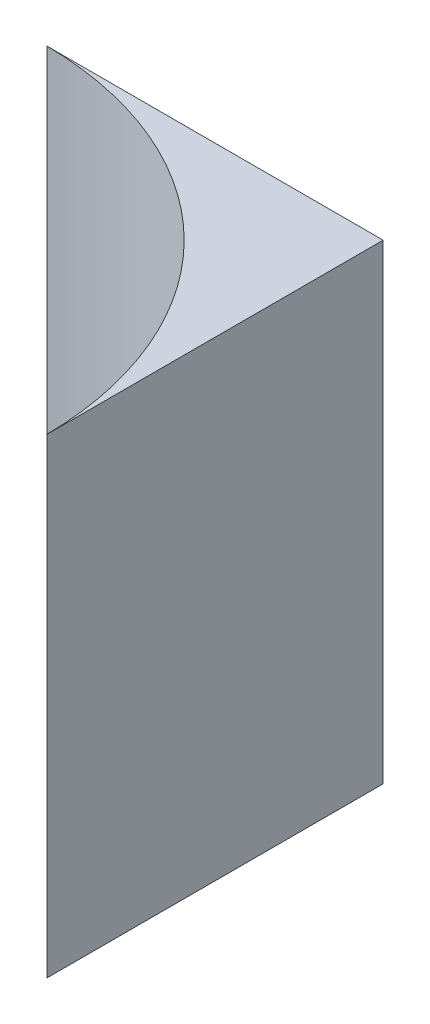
ISO-10303-21;
HEADER;
FILE_DESCRIPTION(('STEP AP214'),'2;1');
FILE_NAME('part.step','',(''),(''),'','','');
FILE_SCHEMA(('AUTOMOTIVE_DESIGN { 1 0 10303 214 1 1 1 1 }'));
ENDSEC;
DATA;
#1=APPLICATION_CONTEXT('core data for automotive mechanical design processes');
#2=APPLICATION_PROTOCOL_DEFINITION('international standard','automotive_design',2000,#1);
#3=PRODUCT_CONTEXT('',#1,'mechanical');
#4=PRODUCT('Part','Part','',(#3));
#5=PRODUCT_RELATED_PRODUCT_CATEGORY('part','',(#4));
#6=PRODUCT_DEFINITION_FORMATION('','',#4);
#7=PRODUCT_DEFINITION_CONTEXT('part definition',#1,'design');
#8=PRODUCT_DEFINITION('design','',#6,#7);
#9=PRODUCT_DEFINITION_SHAPE('','',#8);
#10=(LENGTH_UNIT() NAMED_UNIT(*) SI_UNIT(.MILLI.,.METRE.));
#11=(NAMED_UNIT(*) PLANE_ANGLE_UNIT() SI_UNIT($,.RADIAN.));
#12=(NAMED_UNIT(*) SI_UNIT($,.STERADIAN.) SOLID_ANGLE_UNIT());
#13=UNCERTAINTY_MEASURE_WITH_UNIT(LENGTH_MEASURE(1.E-05),#10,'distance_accuracy_value','');
#14=(GEOMETRIC_REPRESENTATION_CONTEXT(3) GLOBAL_UNCERTAINTY_ASSIGNED_CONTEXT((#13)) GLOBAL_UNIT_ASSIGNED_CONTEXT((#10,
#11,#12)) REPRESENTATION_CONTEXT('',''));
#15=CARTESIAN_POINT('',(0.,0.,0.));
#16=DIRECTION('',(0.,0.,1.));
#17=DIRECTION('',(1.,0.,0.));
#18=AXIS2_PLACEMENT_3D('',#15,#16,#17);
#19=CARTESIAN_POINT('',(-23.2890305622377,33.25,23.2890305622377));
#20=DIRECTION('',(0.,-1.,0.));
#21=DIRECTION('',(0.,0.,-1.));
#22=AXIS2_PLACEMENT_3D('',#19,#20,#21);
#23=CYLINDRICAL_SURFACE('',#22,22.725);
#24=CARTESIAN_POINT('',(-23.2890305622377,1.75,23.2890305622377));
#25=DIRECTION('',(0.,1.,0.));
#26=DIRECTION('',(0.,0.,1.));
#27=AXIS2_PLACEMENT_3D('',#24,#25,#26);
#28=CIRCLE('',#27,22.725);
#29=CARTESIAN_POINT('',(-0.565144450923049,1.75,23.0640305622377));
#30=VERTEX_POINT('',#29);
#31=CARTESIAN_POINT('',(-23.0640305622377,1.75,0.565144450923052));
#32=VERTEX_POINT('',#31);
#33=EDGE_CURVE('E81',#30,#32,#28,.T.);
#34=ORIENTED_EDGE('',*,*,#33,.F.);
#35=DIRECTION('',(0.,-1.,0.));
#36=VECTOR('',#35,1.);
#37=CARTESIAN_POINT('',(-0.565144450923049,33.25,23.0640305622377));
#38=LINE('',#37,#36);
#39=CARTESIAN_POINT('',(-0.565144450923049,33.25,23.0640305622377));
#40=VERTEX_POINT('',#39);
#41=EDGE_CURVE('E50',#40,#30,#38,.T.);
#42=ORIENTED_EDGE('',*,*,#41,.F.);
#43=CARTESIAN_POINT('',(-23.2890305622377,33.25,23.2890305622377));
#44=DIRECTION('',(0.,1.,0.));
#45=DIRECTION('',(0.,0.,1.));
#46=AXIS2_PLACEMENT_3D('',#43,#44,#45);
#47=CIRCLE('',#46,22.725);
#48=CARTESIAN_POINT('',(-23.0640305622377,33.25,0.565144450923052));
#49=VERTEX_POINT('',#48);
#50=EDGE_CURVE('E83',#40,#49,#47,.T.);
#51=ORIENTED_EDGE('',*,*,#50,.T.);
#52=DIRECTION('',(0.,-1.,0.));
#53=VECTOR('',#52,1.);
#54=CARTESIAN_POINT('',(-23.0640305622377,33.25,0.565144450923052));
#55=LINE('',#54,#53);
#56=EDGE_CURVE('E65',#49,#32,#55,.T.);
#57=ORIENTED_EDGE('',*,*,#56,.T.);
#58=EDGE_LOOP('',(#34,#42,#51,#57));
#59=FACE_BOUND('',#58,.T.);
#60=ADVANCED_FACE('F42',(#59),#23,.F.);
#61=CARTESIAN_POINT('',(-0.564030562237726,33.25,23.0640305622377));
#62=DIRECTION('',(0.,0.,-1.));
#63=DIRECTION('',(-1.,0.,0.));
#64=AXIS2_PLACEMENT_3D('',#61,#62,#63);
#65=PLANE('',#64);
#66=DIRECTION('',(1.,0.,0.));
#67=VECTOR('',#66,1.);
#68=CARTESIAN_POINT('',(-0.564030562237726,1.75,23.0640305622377));
#69=LINE('',#68,#67);
#70=CARTESIAN_POINT('',(-0.562916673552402,1.75,23.0640305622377));
#71=VERTEX_POINT('',#70);
#72=EDGE_CURVE('E97',#30,#71,#69,.T.);
#73=ORIENTED_EDGE('',*,*,#72,.T.);
#74=DIRECTION('',(0.,-1.,0.));
#75=VECTOR('',#74,1.);
#76=CARTESIAN_POINT('',(-0.562916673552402,33.25,23.0640305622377));
#77=LINE('',#76,#75);
#78=CARTESIAN_POINT('',(-0.562916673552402,33.25,23.0640305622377));
#79=VERTEX_POINT('',#78);
#80=EDGE_CURVE('E113',#79,#71,#77,.T.);
#81=ORIENTED_EDGE('',*,*,#80,.F.);
#82=DIRECTION('',(1.,0.,0.));
#83=VECTOR('',#82,1.);
#84=CARTESIAN_POINT('',(-0.564030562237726,33.25,23.0640305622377));
#85=LINE('',#84,#83);
#86=EDGE_CURVE('E107',#40,#79,#85,.T.);
#87=ORIENTED_EDGE('',*,*,#86,.F.);
#88=ORIENTED_EDGE('',*,*,#41,.T.);
#89=EDGE_LOOP('',(#73,#81,#87,#88));
#90=FACE_BOUND('',#89,.T.);
#91=ADVANCED_FACE('F119',(#90),#65,.F.);
#92=CARTESIAN_POINT('',(-23.0640305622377,33.25,0.564030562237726));
#93=DIRECTION('',(-1.,0.,0.));
#94=DIRECTION('',(0.,0.,1.));
#95=AXIS2_PLACEMENT_3D('',#92,#93,#94);
#96=PLANE('',#95);
#97=DIRECTION('',(0.,0.,-1.));
#98=VECTOR('',#97,1.);
#99=CARTESIAN_POINT('',(-23.0640305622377,1.75,0.564030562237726));
#100=LINE('',#99,#98);
#101=CARTESIAN_POINT('',(-23.0640305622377,1.75,0.562916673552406));
#102=VERTEX_POINT('',#101);
#103=EDGE_CURVE('E95',#32,#102,#100,.T.);
#104=ORIENTED_EDGE('',*,*,#103,.F.);
#105=ORIENTED_EDGE('',*,*,#56,.F.);
#106=DIRECTION('',(0.,0.,-1.));
#107=VECTOR('',#106,1.);
#108=CARTESIAN_POINT('',(-23.0640305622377,33.25,0.564030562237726));
#109=LINE('',#108,#107);
#110=CARTESIAN_POINT('',(-23.0640305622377,33.25,0.562916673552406));
#111=VERTEX_POINT('',#110);
#112=EDGE_CURVE('E87',#49,#111,#109,.T.);
#113=ORIENTED_EDGE('',*,*,#112,.T.);
#114=DIRECTION('',(0.,-1.,0.));
#115=VECTOR('',#114,1.);
#116=CARTESIAN_POINT('',(-23.0640305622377,33.25,0.562916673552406));
#117=LINE('',#116,#115);
#118=EDGE_CURVE('E86',#111,#102,#117,.T.);
#119=ORIENTED_EDGE('',*,*,#118,.T.);
#120=EDGE_LOOP('',(#104,#105,#113,#119));
#121=FACE_BOUND('',#120,.T.);
#122=ADVANCED_FACE('F102',(#121),#96,.T.);
#123=CARTESIAN_POINT('',(-0.564030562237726,33.25,0.564030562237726));
#124=DIRECTION('',(0.,1.,0.));
#125=DIRECTION('',(0.,0.,1.));
#126=AXIS2_PLACEMENT_3D('',#123,#124,#125);
#127=PLANE('',#126);
#128=DIRECTION('',(1.,0.,0.));
#129=VECTOR('',#128,1.);
#130=CARTESIAN_POINT('',(-23.0640305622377,33.25,0.562916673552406));
#131=LINE('',#130,#129);
#132=CARTESIAN_POINT('',(-0.562916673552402,33.25,0.562916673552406));
#133=VERTEX_POINT('',#132);
#134=EDGE_CURVE('E57',#111,#133,#131,.T.);
#135=ORIENTED_EDGE('',*,*,#134,.F.);
#136=ORIENTED_EDGE('',*,*,#112,.F.);
#137=ORIENTED_EDGE('',*,*,#50,.F.);
#138=ORIENTED_EDGE('',*,*,#86,.T.);
#139=DIRECTION('',(0.,0.,1.));
#140=VECTOR('',#139,1.);
#141=CARTESIAN_POINT('',(-0.562916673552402,33.25,-21.9359694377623));
#142=LINE('',#141,#140);
#143=EDGE_CURVE('E131',#133,#79,#142,.T.);
#144=ORIENTED_EDGE('',*,*,#143,.F.);
#145=EDGE_LOOP('',(#135,#136,#137,#138,#144));
#146=FACE_BOUND('',#145,.T.);
#147=ADVANCED_FACE('F126',(#146),#127,.T.);
#148=CARTESIAN_POINT('',(-0.564030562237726,1.75,0.564030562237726));
#149=DIRECTION('',(0.,1.,0.));
#150=DIRECTION('',(0.,0.,1.));
#151=AXIS2_PLACEMENT_3D('',#148,#149,#150);
#152=PLANE('',#151);
#153=ORIENTED_EDGE('',*,*,#103,.T.);
#154=DIRECTION('',(1.,0.,0.));
#155=VECTOR('',#154,1.);
#156=CARTESIAN_POINT('',(-23.0640305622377,1.75,0.562916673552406));
#157=LINE('',#156,#155);
#158=CARTESIAN_POINT('',(-0.562916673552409,1.75,0.562916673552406));
#159=VERTEX_POINT('',#158);
#160=EDGE_CURVE('E135',#102,#159,#157,.T.);
#161=ORIENTED_EDGE('',*,*,#160,.T.);
#162=DIRECTION('',(0.,0.,1.));
#163=VECTOR('',#162,1.);
#164=CARTESIAN_POINT('',(-0.562916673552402,1.75,-21.9359694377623));
#165=LINE('',#164,#163);
#166=EDGE_CURVE('E99',#159,#71,#165,.T.);
#167=ORIENTED_EDGE('',*,*,#166,.T.);
#168=ORIENTED_EDGE('',*,*,#72,.F.);
#169=ORIENTED_EDGE('',*,*,#33,.T.);
#170=EDGE_LOOP('',(#153,#161,#167,#168,#169));
#171=FACE_BOUND('',#170,.T.);
#172=ADVANCED_FACE('F92',(#171),#152,.F.);
#173=CARTESIAN_POINT('',(-0.562916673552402,1.75,-21.9359694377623));
#174=DIRECTION('',(-1.,0.,0.));
#175=DIRECTION('',(0.,0.,1.));
#176=AXIS2_PLACEMENT_3D('',#173,#174,#175);
#177=PLANE('',#176);
#178=ORIENTED_EDGE('',*,*,#166,.F.);
#179=DIRECTION('',(0.,1.,0.));
#180=VECTOR('',#179,1.);
#181=CARTESIAN_POINT('',(-0.562916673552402,1.75,0.562916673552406));
#182=LINE('',#181,#180);
#183=EDGE_CURVE('E11',#159,#133,#182,.T.);
#184=ORIENTED_EDGE('',*,*,#183,.T.);
#185=ORIENTED_EDGE('',*,*,#143,.T.);
#186=ORIENTED_EDGE('',*,*,#80,.T.);
#187=EDGE_LOOP('',(#178,#184,#185,#186));
#188=FACE_BOUND('',#187,.T.);
#189=ADVANCED_FACE('F146',(#188),#177,.F.);
#190=CARTESIAN_POINT('',(-23.0640305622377,1.75,0.562916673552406));
#191=DIRECTION('',(0.,0.,1.));
#192=DIRECTION('',(1.,0.,0.));
#193=AXIS2_PLACEMENT_3D('',#190,#191,#192);
#194=PLANE('',#193);
#195=ORIENTED_EDGE('',*,*,#160,.F.);
#196=ORIENTED_EDGE('',*,*,#118,.F.);
#197=ORIENTED_EDGE('',*,*,#134,.T.);
#198=ORIENTED_EDGE('',*,*,#183,.F.);
#199=EDGE_LOOP('',(#195,#196,#197,#198));
#200=FACE_BOUND('',#199,.T.);
#201=ADVANCED_FACE('F149',(#200),#194,.F.);
#202=CLOSED_SHELL('',(#60,#91,#122,#147,#172,#189,#201));
#203=MANIFOLD_SOLID_BREP('B2',#202);
#204=ADVANCED_BREP_SHAPE_REPRESENTATION('',(#18,#203),#14);
#205=SHAPE_DEFINITION_REPRESENTATION(#9,#204);
ENDSEC;
END-ISO-10303-21;
